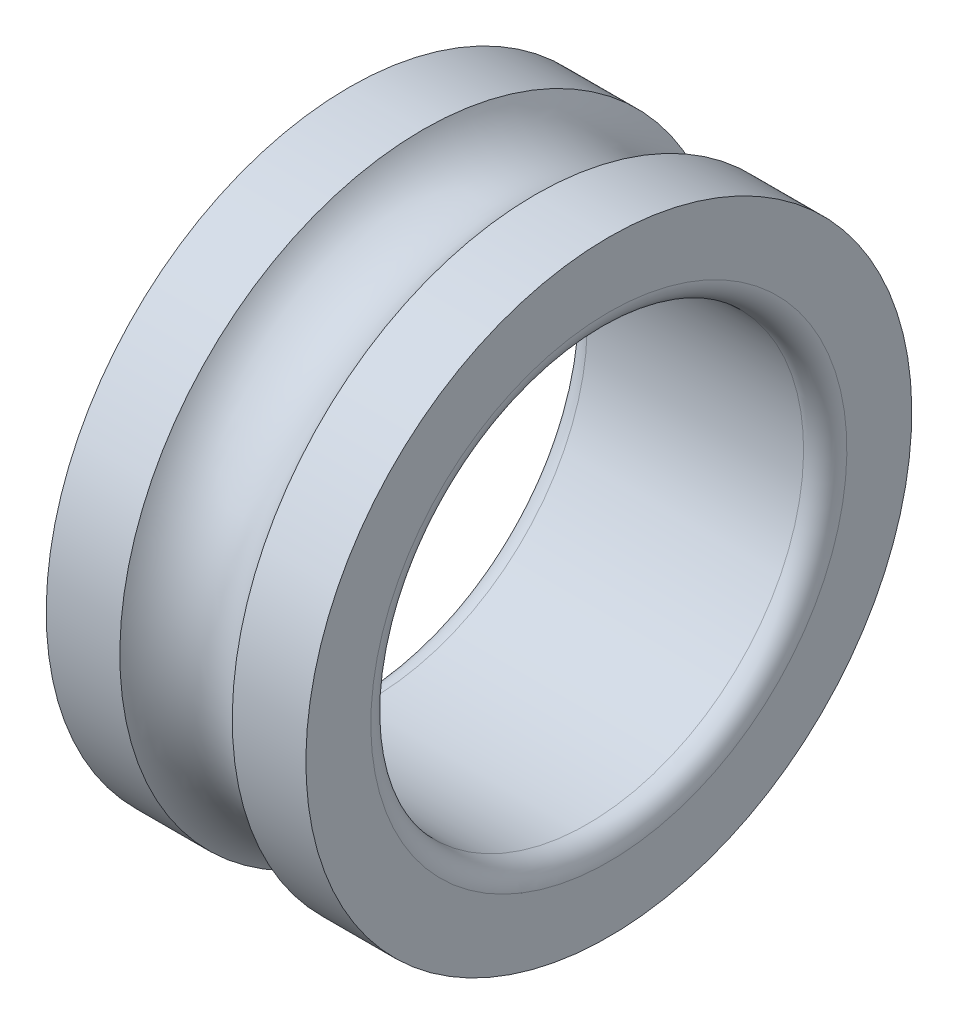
from build123d import *


with BuildPart() as part:
    # Esquisse1 → Base-R_volution (revolve)
    with BuildSketch(Plane.XY):
        with BuildLine():
            Line((-6, 97.5), (4, 97.5))
            ThreePointArc((4, 97.5), (4.707106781, 97.792893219), (5, 98.5))
            Line((5, 98.5), (5, 101.5))
            Line((5, 101.5), (1.598076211, 101.5))
            ThreePointArc((1.598076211, 101.5), (-1, 100), (-3.598076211, 101.5))
            Line((-3.598076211, 101.5), (-7, 101.5))
            Line((-7, 101.5), (-7, 98.5))
            ThreePointArc((-7, 98.5), (-6.707106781, 97.792893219), (-6, 97.5))
        make_face()
    revolve(axis=Axis((20, 87.5, 0), (-1, 0, 0)))


solid = part.part
